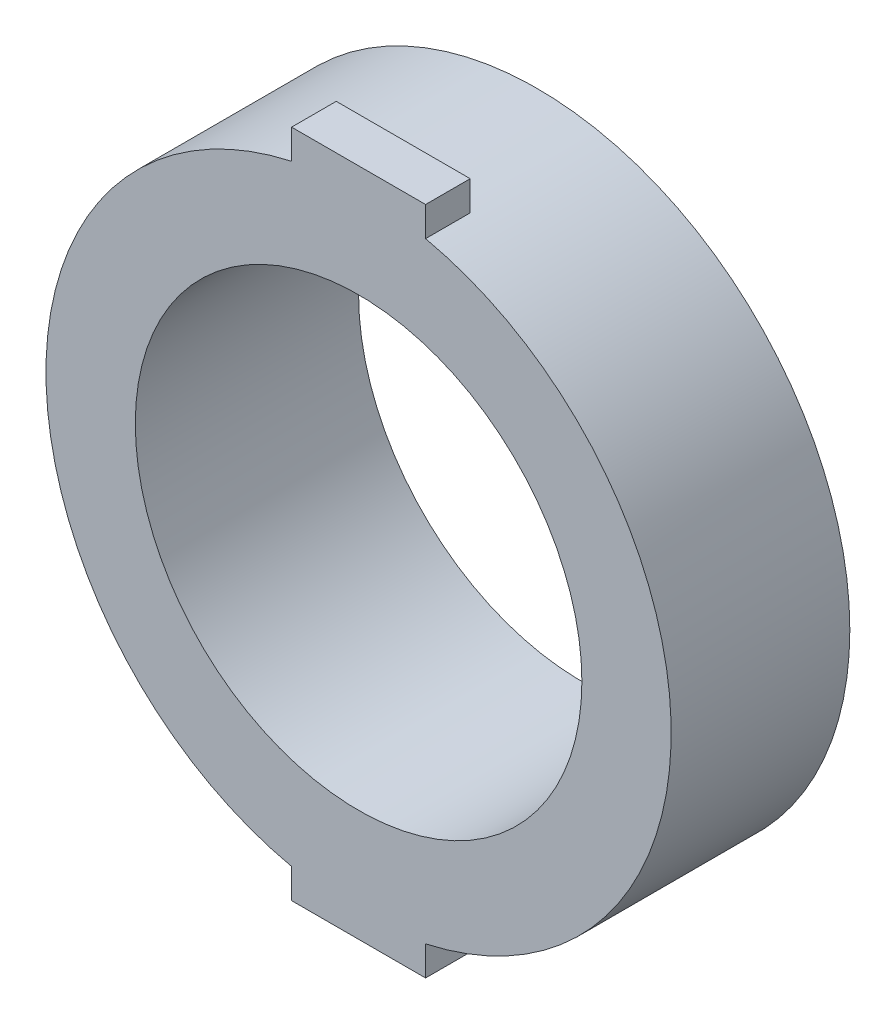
from build123d import *
from build123d.topology import SkipClean

# Parameters (mm, degrees)
ESQUISSE1_R          = 7
ESQUISSE1_R_2        = 5
BASE_EXTRUSION_DEPTH = 4
ESQUISSE2_W          = 3
ESQUISSE2_H          = 1.354699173
ESQUISSE2_H_2        = 1.424931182
BOSS_EXTRU_1_DEPTH   = 1
BOSS_EXTRU_2_START   = 1
ESQUISSE3_R          = 5.5
ESQUISSE3_R_2        = 5
BOSS_EXTRU_2_DEPTH   = 1


with BuildPart() as part:
    # Esquisse1 → Base-Extrusion (new body)
    with BuildSketch(Plane.XY):
        Circle(ESQUISSE1_R)
        Circle(ESQUISSE1_R_2, mode=Mode.SUBTRACT)
    extrude(amount=BASE_EXTRUSION_DEPTH)

    # Esquisse2 → Boss.-Extru.1 (add)
    with BuildSketch(Plane.XY.offset(4)):
        with Locations((0, 6.822650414)):
            Rectangle(ESQUISSE2_W, ESQUISSE2_H)
        with Locations((0, -6.787534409)):
            Rectangle(ESQUISSE2_W, ESQUISSE2_H_2)
    extrude(amount=-BOSS_EXTRU_1_DEPTH)

    # Esquisse3 → Boss.-Extru.2 (add)
    with SkipClean():  # the faces are left unmerged after this step: merging them gives an invalid solid
        with BuildSketch(Plane(origin=(0, 0, 0), x_dir=(-1, 0, 0), z_dir=(0, 0, -1)).offset(BOSS_EXTRU_2_START)):
            with Locations(Location((0, 0, 0), (0, 0, 180))):
                Circle(ESQUISSE3_R)
            Circle(ESQUISSE3_R_2, mode=Mode.SUBTRACT)
        extrude(amount=-BOSS_EXTRU_2_DEPTH)


solid = part.part
